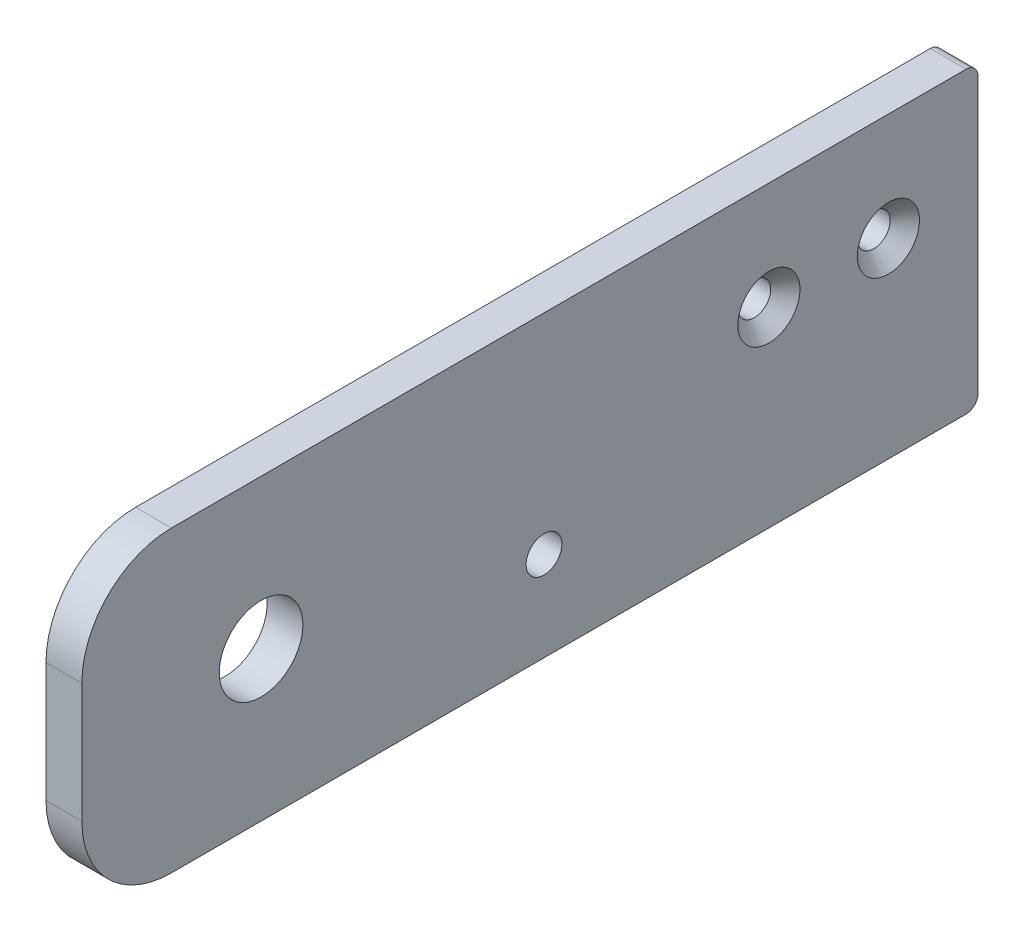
from build123d import *

# Parameters (mm, degrees)
CROQUIS1_W                                           = 150
CROQUIS1_H                                           = 50
SALIENTE_EXTRUIR1_DEPTH                              = 6
CROQUIS2_R                                           = 3
CORTAR_EXTRUIR1_DEPTH                                = 159.227684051
AVELLANADO_PARA_TORNILLO_CON_CABEZA_PLAN_D           = 5.5
AVELLANADO_PARA_TORNILLO_CON_CABEZA_PLAN_CSINK_D     = 10.4
AVELLANADO_PARA_TORNILLO_CON_CABEZA_PLAN_CSINK_ANGLE = 90
REDONDEO1_R                                          = 2
REDONDEO2_R                                          = 15
REDONDEO3_R                                          = 15
REDONDEO4_R                                          = 2
CROQUIS5_R                                           = 7
CORTAR_EXTRUIR2_DEPTH                                = 10


with BuildPart() as part:
    # Croquis1 → Saliente-Extruir1 (new body)
    with BuildSketch(Plane(origin=(6, 0, 0), x_dir=(0, 0, -1), z_dir=(1, 0, 0))):
        with Locations((-75, -25)):
            Rectangle(CROQUIS1_W, CROQUIS1_H)
    extrude(amount=-SALIENTE_EXTRUIR1_DEPTH)

    # Croquis2 → Cortar-Extruir1 (cut, through all)
    with BuildSketch(Plane.ZY):
        with Locations(Location((72.643681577, -35, 0), (0, 0, 270))):
            Circle(CROQUIS2_R)
    extrude(amount=-CORTAR_EXTRUIR1_DEPTH, mode=Mode.SUBTRACT)

    # Avellanado para tornillo con cabeza plan (through all)
    with Locations(Plane(origin=(6, 0, 0), x_dir=(0, 0, -1), z_dir=(1, 0, 0))):
        with Locations((-15, -18), (-35, -18)):
            CounterSinkHole(AVELLANADO_PARA_TORNILLO_CON_CABEZA_PLAN_D / 2, AVELLANADO_PARA_TORNILLO_CON_CABEZA_PLAN_CSINK_D / 2, counter_sink_angle=AVELLANADO_PARA_TORNILLO_CON_CABEZA_PLAN_CSINK_ANGLE)

    # Redondeo1
    redondeo1_edges = [part.edges().sort_by_distance(p)[0] for p in [
        (3, -50, 0),
    ]]
    fillet(redondeo1_edges, radius=REDONDEO1_R)

    # Redondeo2
    redondeo2_edges = [part.edges().sort_by_distance(p)[0] for p in [
        (3, -50, 150),
    ]]
    fillet(redondeo2_edges, radius=REDONDEO2_R)

    # Redondeo3
    redondeo3_edges = [part.edges().sort_by_distance(p)[0] for p in [
        (3, 0, 150),
    ]]
    fillet(redondeo3_edges, radius=REDONDEO3_R)

    # Redondeo4
    redondeo4_edges = [part.edges().sort_by_distance(p)[0] for p in [
        (3, 0, 0),
    ]]
    fillet(redondeo4_edges, radius=REDONDEO4_R)

    # Croquis5 → Cortar-Extruir2 (cut)
    with BuildSketch(Plane(origin=(6, 0, 0), x_dir=(0, 0, -1), z_dir=(1, 0, 0))):
        with Locations((-120, -25)):
            Circle(CROQUIS5_R)
    extrude(amount=-CORTAR_EXTRUIR2_DEPTH, mode=Mode.SUBTRACT)


solid = part.part
